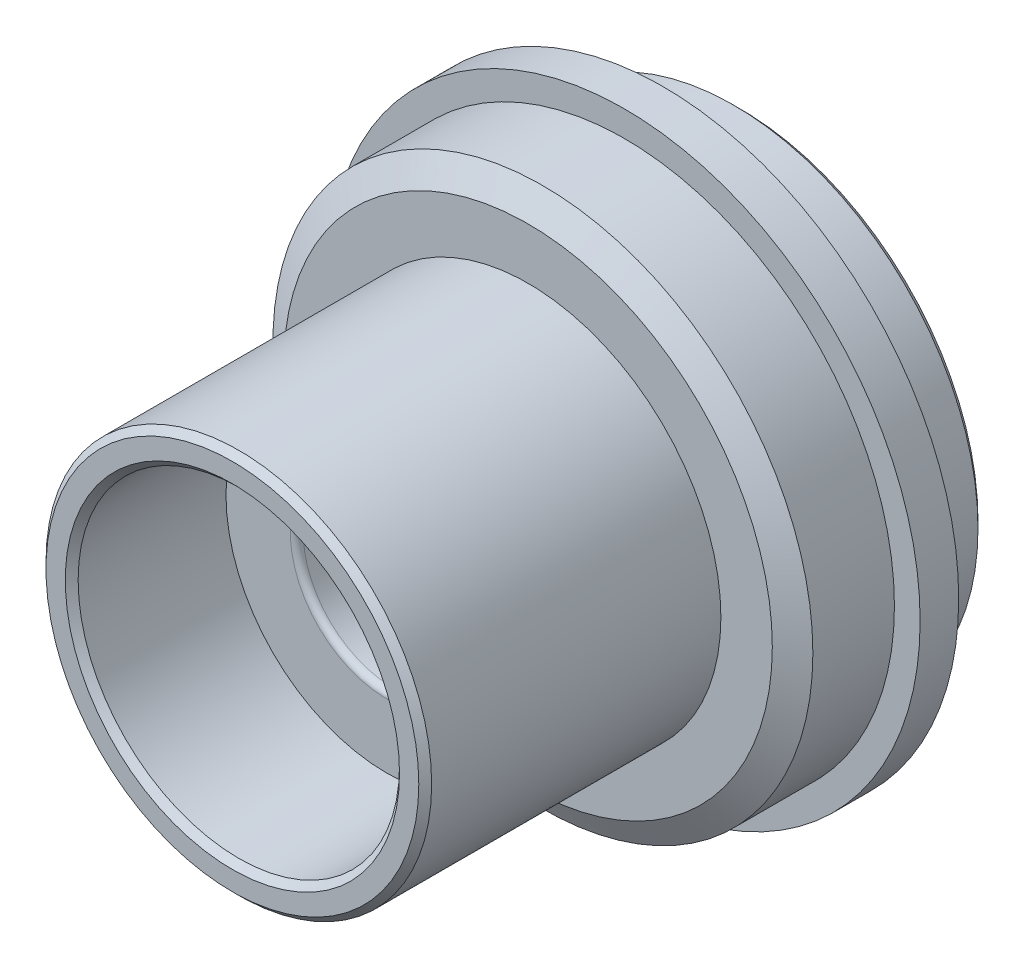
ISO-10303-21;
HEADER;
FILE_DESCRIPTION(('STEP AP214'),'2;1');
FILE_NAME('part.step','',(''),(''),'','','');
FILE_SCHEMA(('AUTOMOTIVE_DESIGN { 1 0 10303 214 1 1 1 1 }'));
ENDSEC;
DATA;
#1=APPLICATION_CONTEXT('core data for automotive mechanical design processes');
#2=APPLICATION_PROTOCOL_DEFINITION('international standard','automotive_design',2000,#1);
#3=PRODUCT_CONTEXT('',#1,'mechanical');
#4=PRODUCT('Part','Part','',(#3));
#5=PRODUCT_RELATED_PRODUCT_CATEGORY('part','',(#4));
#6=PRODUCT_DEFINITION_FORMATION('','',#4);
#7=PRODUCT_DEFINITION_CONTEXT('part definition',#1,'design');
#8=PRODUCT_DEFINITION('design','',#6,#7);
#9=PRODUCT_DEFINITION_SHAPE('','',#8);
#10=(LENGTH_UNIT() NAMED_UNIT(*) SI_UNIT(.MILLI.,.METRE.));
#11=(NAMED_UNIT(*) PLANE_ANGLE_UNIT() SI_UNIT($,.RADIAN.));
#12=(NAMED_UNIT(*) SI_UNIT($,.STERADIAN.) SOLID_ANGLE_UNIT());
#13=UNCERTAINTY_MEASURE_WITH_UNIT(LENGTH_MEASURE(1.E-05),#10,'distance_accuracy_value','');
#14=(GEOMETRIC_REPRESENTATION_CONTEXT(3) GLOBAL_UNCERTAINTY_ASSIGNED_CONTEXT((#13)) GLOBAL_UNIT_ASSIGNED_CONTEXT((#10,
#11,#12)) REPRESENTATION_CONTEXT('',''));
#15=CARTESIAN_POINT('',(0.,0.,0.));
#16=DIRECTION('',(0.,0.,1.));
#17=DIRECTION('',(1.,0.,0.));
#18=AXIS2_PLACEMENT_3D('',#15,#16,#17);
#19=CARTESIAN_POINT('',(0.,0.,0.));
#20=DIRECTION('',(0.,0.,1.));
#21=DIRECTION('',(1.,0.,0.));
#22=AXIS2_PLACEMENT_3D('',#19,#20,#21);
#23=CYLINDRICAL_SURFACE('',#22,7.);
#24=CARTESIAN_POINT('',(0.,0.,13.5));
#25=DIRECTION('',(0.,0.,-1.));
#26=DIRECTION('',(-1.,0.,0.));
#27=AXIS2_PLACEMENT_3D('',#24,#25,#26);
#28=CIRCLE('',#27,7.);
#29=CARTESIAN_POINT('',(-7.,0.,13.5));
#30=VERTEX_POINT('',#29);
#31=EDGE_CURVE('E265',#30,#30,#28,.T.);
#32=ORIENTED_EDGE('',*,*,#31,.T.);
#33=EDGE_LOOP('',(#32));
#34=FACE_BOUND('',#33,.T.);
#35=CARTESIAN_POINT('',(0.,0.,15.5));
#36=DIRECTION('',(0.,0.,-1.));
#37=DIRECTION('',(-1.,0.,0.));
#38=AXIS2_PLACEMENT_3D('',#35,#36,#37);
#39=CIRCLE('',#38,7.);
#40=CARTESIAN_POINT('',(-7.,0.,15.5));
#41=VERTEX_POINT('',#40);
#42=EDGE_CURVE('E259',#41,#41,#39,.F.);
#43=ORIENTED_EDGE('',*,*,#42,.T.);
#44=EDGE_LOOP('',(#43));
#45=FACE_BOUND('',#44,.T.);
#46=ADVANCED_FACE('F24',(#34,#45),#23,.F.);
#47=CARTESIAN_POINT('',(0.,0.,6.));
#48=DIRECTION('',(0.,0.,-1.));
#49=DIRECTION('',(-1.,0.,0.));
#50=AXIS2_PLACEMENT_3D('',#47,#48,#49);
#51=CYLINDRICAL_SURFACE('',#50,19.);
#52=CARTESIAN_POINT('',(0.,0.,0.500000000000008));
#53=DIRECTION('',(0.,0.,1.));
#54=DIRECTION('',(1.,0.,0.));
#55=AXIS2_PLACEMENT_3D('',#52,#53,#54);
#56=CIRCLE('',#55,19.);
#57=CARTESIAN_POINT('',(19.,0.,0.500000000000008));
#58=VERTEX_POINT('',#57);
#59=EDGE_CURVE('E289',#58,#58,#56,.T.);
#60=ORIENTED_EDGE('',*,*,#59,.T.);
#61=EDGE_LOOP('',(#60));
#62=FACE_BOUND('',#61,.T.);
#63=CARTESIAN_POINT('',(0.,0.,6.));
#64=DIRECTION('',(0.,0.,1.));
#65=DIRECTION('',(1.,0.,0.));
#66=AXIS2_PLACEMENT_3D('',#63,#64,#65);
#67=CIRCLE('',#66,19.);
#68=CARTESIAN_POINT('',(19.,0.,6.));
#69=VERTEX_POINT('',#68);
#70=EDGE_CURVE('E121',#69,#69,#67,.T.);
#71=ORIENTED_EDGE('',*,*,#70,.F.);
#72=EDGE_LOOP('',(#71));
#73=FACE_BOUND('',#72,.T.);
#74=ADVANCED_FACE('F26',(#62,#73),#51,.T.);
#75=CARTESIAN_POINT('',(0.,0.,0.));
#76=DIRECTION('',(0.,0.,1.));
#77=DIRECTION('',(1.,0.,0.));
#78=AXIS2_PLACEMENT_3D('',#75,#76,#77);
#79=PLANE('',#78);
#80=CARTESIAN_POINT('',(0.,0.,0.));
#81=DIRECTION('',(0.,0.,1.));
#82=DIRECTION('',(1.,0.,0.));
#83=AXIS2_PLACEMENT_3D('',#80,#81,#82);
#84=CIRCLE('',#83,18.5);
#85=CARTESIAN_POINT('',(18.5,0.,0.));
#86=VERTEX_POINT('',#85);
#87=EDGE_CURVE('E293',#86,#86,#84,.F.);
#88=ORIENTED_EDGE('',*,*,#87,.T.);
#89=EDGE_LOOP('',(#88));
#90=FACE_BOUND('',#89,.T.);
#91=DIRECTION('',(0.,1.,0.));
#92=VECTOR('',#91,1.);
#93=CARTESIAN_POINT('',(-2.5,14.3,0.));
#94=LINE('',#93,#92);
#95=CARTESIAN_POINT('',(-2.5,12.2474487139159,0.));
#96=VERTEX_POINT('',#95);
#97=CARTESIAN_POINT('',(-2.5,14.3,0.));
#98=VERTEX_POINT('',#97);
#99=EDGE_CURVE('E72',#96,#98,#94,.T.);
#100=ORIENTED_EDGE('',*,*,#99,.F.);
#101=CARTESIAN_POINT('',(0.,0.,0.));
#102=DIRECTION('',(0.,0.,1.));
#103=DIRECTION('',(1.,0.,0.));
#104=AXIS2_PLACEMENT_3D('',#101,#102,#103);
#105=CIRCLE('',#104,12.5);
#106=CARTESIAN_POINT('',(2.5,12.2474487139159,0.));
#107=VERTEX_POINT('',#106);
#108=EDGE_CURVE('E292',#96,#107,#105,.T.);
#109=ORIENTED_EDGE('',*,*,#108,.T.);
#110=DIRECTION('',(0.,-1.,0.));
#111=VECTOR('',#110,1.);
#112=CARTESIAN_POINT('',(2.5,14.3,0.));
#113=LINE('',#112,#111);
#114=CARTESIAN_POINT('',(2.5,14.3,0.));
#115=VERTEX_POINT('',#114);
#116=EDGE_CURVE('E93',#115,#107,#113,.T.);
#117=ORIENTED_EDGE('',*,*,#116,.F.);
#118=DIRECTION('',(1.,0.,0.));
#119=VECTOR('',#118,1.);
#120=CARTESIAN_POINT('',(2.5,14.3,0.));
#121=LINE('',#120,#119);
#122=EDGE_CURVE('E81',#98,#115,#121,.T.);
#123=ORIENTED_EDGE('',*,*,#122,.F.);
#124=EDGE_LOOP('',(#100,#109,#117,#123));
#125=FACE_BOUND('',#124,.T.);
#126=ADVANCED_FACE('F95',(#90,#125),#79,.F.);
#127=CARTESIAN_POINT('',(0.,0.,6.));
#128=DIRECTION('',(0.,0.,1.));
#129=DIRECTION('',(1.,0.,0.));
#130=AXIS2_PLACEMENT_3D('',#127,#128,#129);
#131=PLANE('',#130);
#132=CARTESIAN_POINT('',(0.,0.,6.));
#133=DIRECTION('',(0.,0.,1.));
#134=DIRECTION('',(1.,0.,0.));
#135=AXIS2_PLACEMENT_3D('',#132,#133,#134);
#136=CIRCLE('',#135,23.);
#137=CARTESIAN_POINT('',(23.,0.,6.));
#138=VERTEX_POINT('',#137);
#139=EDGE_CURVE('E112',#138,#138,#136,.T.);
#140=ORIENTED_EDGE('',*,*,#139,.F.);
#141=EDGE_LOOP('',(#140));
#142=FACE_BOUND('',#141,.T.);
#143=ORIENTED_EDGE('',*,*,#70,.T.);
#144=EDGE_LOOP('',(#143));
#145=FACE_BOUND('',#144,.T.);
#146=ADVANCED_FACE('F326',(#142,#145),#131,.F.);
#147=CARTESIAN_POINT('',(0.,0.,9.));
#148=DIRECTION('',(0.,0.,-1.));
#149=DIRECTION('',(-1.,0.,0.));
#150=AXIS2_PLACEMENT_3D('',#147,#148,#149);
#151=CYLINDRICAL_SURFACE('',#150,23.);
#152=CARTESIAN_POINT('',(0.,0.,9.));
#153=DIRECTION('',(0.,0.,1.));
#154=DIRECTION('',(1.,0.,0.));
#155=AXIS2_PLACEMENT_3D('',#152,#153,#154);
#156=CIRCLE('',#155,23.);
#157=CARTESIAN_POINT('',(23.,0.,9.));
#158=VERTEX_POINT('',#157);
#159=EDGE_CURVE('E124',#158,#158,#156,.T.);
#160=ORIENTED_EDGE('',*,*,#159,.F.);
#161=EDGE_LOOP('',(#160));
#162=FACE_BOUND('',#161,.T.);
#163=ORIENTED_EDGE('',*,*,#139,.T.);
#164=EDGE_LOOP('',(#163));
#165=FACE_BOUND('',#164,.T.);
#166=ADVANCED_FACE('F332',(#162,#165),#151,.T.);
#167=CARTESIAN_POINT('',(0.,0.,9.));
#168=DIRECTION('',(0.,0.,1.));
#169=DIRECTION('',(1.,0.,0.));
#170=AXIS2_PLACEMENT_3D('',#167,#168,#169);
#171=PLANE('',#170);
#172=CARTESIAN_POINT('',(0.,0.,9.));
#173=DIRECTION('',(0.,0.,1.));
#174=DIRECTION('',(1.,0.,0.));
#175=AXIS2_PLACEMENT_3D('',#172,#173,#174);
#176=CIRCLE('',#175,21.);
#177=CARTESIAN_POINT('',(21.,0.,9.));
#178=VERTEX_POINT('',#177);
#179=EDGE_CURVE('E118',#178,#178,#176,.T.);
#180=ORIENTED_EDGE('',*,*,#179,.F.);
#181=EDGE_LOOP('',(#180));
#182=FACE_BOUND('',#181,.T.);
#183=ORIENTED_EDGE('',*,*,#159,.T.);
#184=EDGE_LOOP('',(#183));
#185=FACE_BOUND('',#184,.T.);
#186=ADVANCED_FACE('F338',(#182,#185),#171,.T.);
#187=CARTESIAN_POINT('',(0.,0.,16.5));
#188=DIRECTION('',(0.,0.,-1.));
#189=DIRECTION('',(-1.,0.,0.));
#190=AXIS2_PLACEMENT_3D('',#187,#188,#189);
#191=CYLINDRICAL_SURFACE('',#190,21.);
#192=CARTESIAN_POINT('',(0.,0.,15.3452994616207));
#193=DIRECTION('',(0.,0.,1.));
#194=DIRECTION('',(1.,0.,0.));
#195=AXIS2_PLACEMENT_3D('',#192,#193,#194);
#196=CIRCLE('',#195,21.);
#197=CARTESIAN_POINT('',(21.,0.,15.3452994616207));
#198=VERTEX_POINT('',#197);
#199=EDGE_CURVE('E11',#198,#198,#196,.F.);
#200=ORIENTED_EDGE('',*,*,#199,.T.);
#201=EDGE_LOOP('',(#200));
#202=FACE_BOUND('',#201,.T.);
#203=ORIENTED_EDGE('',*,*,#179,.T.);
#204=EDGE_LOOP('',(#203));
#205=FACE_BOUND('',#204,.T.);
#206=ADVANCED_FACE('F344',(#202,#205),#191,.T.);
#207=CARTESIAN_POINT('',(0.,0.,16.5));
#208=DIRECTION('',(0.,0.,1.));
#209=DIRECTION('',(1.,0.,0.));
#210=AXIS2_PLACEMENT_3D('',#207,#208,#209);
#211=PLANE('',#210);
#212=CARTESIAN_POINT('',(0.,0.,16.5));
#213=DIRECTION('',(0.,0.,1.));
#214=DIRECTION('',(1.,0.,0.));
#215=AXIS2_PLACEMENT_3D('',#212,#213,#214);
#216=CIRCLE('',#215,19.);
#217=CARTESIAN_POINT('',(19.,0.,16.5));
#218=VERTEX_POINT('',#217);
#219=EDGE_CURVE('E32',#218,#218,#216,.T.);
#220=ORIENTED_EDGE('',*,*,#219,.T.);
#221=EDGE_LOOP('',(#220));
#222=FACE_BOUND('',#221,.T.);
#223=CARTESIAN_POINT('',(0.,0.,16.5));
#224=DIRECTION('',(0.,0.,1.));
#225=DIRECTION('',(1.,0.,0.));
#226=AXIS2_PLACEMENT_3D('',#223,#224,#225);
#227=CIRCLE('',#226,15.);
#228=CARTESIAN_POINT('',(15.,0.,16.5));
#229=VERTEX_POINT('',#228);
#230=EDGE_CURVE('E114',#229,#229,#227,.T.);
#231=ORIENTED_EDGE('',*,*,#230,.F.);
#232=EDGE_LOOP('',(#231));
#233=FACE_BOUND('',#232,.T.);
#234=ADVANCED_FACE('F304',(#222,#233),#211,.T.);
#235=CARTESIAN_POINT('',(0.,0.,39.5));
#236=DIRECTION('',(0.,0.,-1.));
#237=DIRECTION('',(-1.,0.,0.));
#238=AXIS2_PLACEMENT_3D('',#235,#236,#237);
#239=CYLINDRICAL_SURFACE('',#238,15.);
#240=CARTESIAN_POINT('',(0.,0.,39.));
#241=DIRECTION('',(0.,0.,1.));
#242=DIRECTION('',(1.,0.,0.));
#243=AXIS2_PLACEMENT_3D('',#240,#241,#242);
#244=CIRCLE('',#243,15.);
#245=CARTESIAN_POINT('',(15.,0.,39.));
#246=VERTEX_POINT('',#245);
#247=EDGE_CURVE('E283',#246,#246,#244,.F.);
#248=ORIENTED_EDGE('',*,*,#247,.T.);
#249=EDGE_LOOP('',(#248));
#250=FACE_BOUND('',#249,.T.);
#251=ORIENTED_EDGE('',*,*,#230,.T.);
#252=EDGE_LOOP('',(#251));
#253=FACE_BOUND('',#252,.T.);
#254=ADVANCED_FACE('F360',(#250,#253),#239,.T.);
#255=CARTESIAN_POINT('',(0.,0.,39.5));
#256=DIRECTION('',(0.,0.,1.));
#257=DIRECTION('',(1.,0.,0.));
#258=AXIS2_PLACEMENT_3D('',#255,#256,#257);
#259=PLANE('',#258);
#260=CARTESIAN_POINT('',(0.,0.,39.5));
#261=DIRECTION('',(0.,0.,1.));
#262=DIRECTION('',(1.,0.,0.));
#263=AXIS2_PLACEMENT_3D('',#260,#261,#262);
#264=CIRCLE('',#263,14.5);
#265=CARTESIAN_POINT('',(14.5,0.,39.5));
#266=VERTEX_POINT('',#265);
#267=EDGE_CURVE('E280',#266,#266,#264,.T.);
#268=ORIENTED_EDGE('',*,*,#267,.T.);
#269=EDGE_LOOP('',(#268));
#270=FACE_BOUND('',#269,.T.);
#271=CARTESIAN_POINT('',(0.,0.,39.5));
#272=DIRECTION('',(0.,0.,1.));
#273=DIRECTION('',(1.,0.,0.));
#274=AXIS2_PLACEMENT_3D('',#271,#272,#273);
#275=CIRCLE('',#274,13.);
#276=CARTESIAN_POINT('',(13.,0.,39.5));
#277=VERTEX_POINT('',#276);
#278=EDGE_CURVE('E277',#277,#277,#275,.F.);
#279=ORIENTED_EDGE('',*,*,#278,.T.);
#280=EDGE_LOOP('',(#279));
#281=FACE_BOUND('',#280,.T.);
#282=ADVANCED_FACE('F364',(#270,#281),#259,.T.);
#283=CARTESIAN_POINT('',(0.,0.,13.));
#284=DIRECTION('',(0.,0.,-1.));
#285=DIRECTION('',(-1.,0.,0.));
#286=AXIS2_PLACEMENT_3D('',#283,#284,#285);
#287=CYLINDRICAL_SURFACE('',#286,12.);
#288=DIRECTION('',(0.,0.,-1.));
#289=VECTOR('',#288,1.);
#290=CARTESIAN_POINT('',(2.5,11.7366945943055,13.));
#291=LINE('',#290,#289);
#292=CARTESIAN_POINT('',(2.5,11.7366945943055,6.00000000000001));
#293=VERTEX_POINT('',#292);
#294=CARTESIAN_POINT('',(2.5,11.7366945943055,0.500000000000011));
#295=VERTEX_POINT('',#294);
#296=EDGE_CURVE('E103',#293,#295,#291,.T.);
#297=ORIENTED_EDGE('',*,*,#296,.T.);
#298=CARTESIAN_POINT('',(0.,0.,0.500000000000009));
#299=DIRECTION('',(0.,0.,1.));
#300=DIRECTION('',(1.,0.,0.));
#301=AXIS2_PLACEMENT_3D('',#298,#299,#300);
#302=CIRCLE('',#301,12.);
#303=CARTESIAN_POINT('',(-2.5,11.7366945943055,0.500000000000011));
#304=VERTEX_POINT('',#303);
#305=EDGE_CURVE('E160',#295,#304,#302,.F.);
#306=ORIENTED_EDGE('',*,*,#305,.T.);
#307=DIRECTION('',(0.,0.,-1.));
#308=VECTOR('',#307,1.);
#309=CARTESIAN_POINT('',(-2.5,11.7366945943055,13.));
#310=LINE('',#309,#308);
#311=CARTESIAN_POINT('',(-2.5,11.7366945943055,6.00000000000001));
#312=VERTEX_POINT('',#311);
#313=EDGE_CURVE('E100',#304,#312,#310,.F.);
#314=ORIENTED_EDGE('',*,*,#313,.T.);
#315=CARTESIAN_POINT('',(0.,0.,6.00000000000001));
#316=DIRECTION('',(0.,0.,1.));
#317=DIRECTION('',(1.,0.,0.));
#318=AXIS2_PLACEMENT_3D('',#315,#316,#317);
#319=CIRCLE('',#318,12.);
#320=EDGE_CURVE('E108',#312,#293,#319,.T.);
#321=ORIENTED_EDGE('',*,*,#320,.T.);
#322=EDGE_LOOP('',(#297,#306,#314,#321));
#323=FACE_BOUND('',#322,.T.);
#324=ADVANCED_FACE('F298',(#323),#287,.F.);
#325=CARTESIAN_POINT('',(0.,11.,12.));
#326=DIRECTION('',(0.,0.,1.));
#327=DIRECTION('',(1.,0.,0.));
#328=AXIS2_PLACEMENT_3D('',#325,#326,#327);
#329=PLANE('',#328);
#330=CARTESIAN_POINT('',(0.,0.,12.));
#331=DIRECTION('',(0.,0.,-1.));
#332=DIRECTION('',(-1.,0.,0.));
#333=AXIS2_PLACEMENT_3D('',#330,#331,#332);
#334=CIRCLE('',#333,15.);
#335=CARTESIAN_POINT('',(-15.,0.,12.));
#336=VERTEX_POINT('',#335);
#337=EDGE_CURVE('E105',#336,#336,#334,.T.);
#338=ORIENTED_EDGE('',*,*,#337,.T.);
#339=EDGE_LOOP('',(#338));
#340=FACE_BOUND('',#339,.T.);
#341=CARTESIAN_POINT('',(0.,0.,12.));
#342=DIRECTION('',(0.,0.,1.));
#343=DIRECTION('',(1.,0.,0.));
#344=AXIS2_PLACEMENT_3D('',#341,#342,#343);
#345=CIRCLE('',#344,12.);
#346=CARTESIAN_POINT('',(-12.,0.,12.));
#347=VERTEX_POINT('',#346);
#348=EDGE_CURVE('E113',#347,#347,#345,.F.);
#349=ORIENTED_EDGE('',*,*,#348,.F.);
#350=EDGE_LOOP('',(#349));
#351=FACE_BOUND('',#350,.T.);
#352=ADVANCED_FACE('F373',(#340,#351),#329,.F.);
#353=CARTESIAN_POINT('',(0.,0.,4.));
#354=DIRECTION('',(0.,0.,1.));
#355=DIRECTION('',(1.,0.,0.));
#356=AXIS2_PLACEMENT_3D('',#353,#354,#355);
#357=CONICAL_SURFACE('',#356,11.,0.463647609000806);
#358=ORIENTED_EDGE('',*,*,#337,.F.);
#359=EDGE_LOOP('',(#358));
#360=FACE_BOUND('',#359,.T.);
#361=CARTESIAN_POINT('',(-5.64154935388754,14.3,12.7452161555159));
#362=CARTESIAN_POINT('',(-5.5039150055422,14.3,12.6442071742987));
#363=CARTESIAN_POINT('',(-5.36475080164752,14.3,12.5452525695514));
#364=CARTESIAN_POINT('',(-5.08327714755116,14.3,12.352080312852));
#365=CARTESIAN_POINT('',(-4.94096927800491,14.3,12.2578603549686));
#366=CARTESIAN_POINT('',(-4.65222855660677,14.3,12.0742022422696));
#367=CARTESIAN_POINT('',(-4.50577791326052,14.3,11.9847919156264));
#368=CARTESIAN_POINT('',(-4.20925875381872,14.3,11.8119258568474));
#369=CARTESIAN_POINT('',(-4.05918745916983,14.3,11.728474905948));
#370=CARTESIAN_POINT('',(-3.59931811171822,14.3,11.4860501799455));
#371=CARTESIAN_POINT('',(-3.28384265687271,14.3,11.3375825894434));
#372=CARTESIAN_POINT('',(-2.63868083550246,14.3,11.0759871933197));
#373=CARTESIAN_POINT('',(-2.3090112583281,14.3,10.9628188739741));
#374=CARTESIAN_POINT('',(-1.76051384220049,14.3,10.8128303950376));
#375=CARTESIAN_POINT('',(-1.5451576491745,14.3,10.7632204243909));
#376=CARTESIAN_POINT('',(-1.1108756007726,14.3,10.6829113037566));
#377=CARTESIAN_POINT('',(-0.891949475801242,14.3,10.6522135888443));
#378=CARTESIAN_POINT('',(-0.454185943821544,14.3,10.6111106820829));
#379=CARTESIAN_POINT('',(-0.235365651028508,14.3,10.6005244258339));
#380=CARTESIAN_POINT('',(0.202314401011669,14.3,10.5995137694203));
#381=CARTESIAN_POINT('',(0.421174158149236,14.3,10.609088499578));
#382=CARTESIAN_POINT('',(0.856577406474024,14.3,10.6479686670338));
#383=CARTESIAN_POINT('',(1.07312524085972,14.3,10.6772259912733));
#384=CARTESIAN_POINT('',(1.50286958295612,14.3,10.7543245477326));
#385=CARTESIAN_POINT('',(1.71606583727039,14.3,10.8021671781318));
#386=CARTESIAN_POINT('',(2.13997521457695,14.3,10.9153881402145));
#387=CARTESIAN_POINT('',(2.35064290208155,14.3,10.9809352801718));
#388=CARTESIAN_POINT('',(2.76649040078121,14.3,11.1274136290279));
#389=CARTESIAN_POINT('',(2.97167044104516,14.3,11.208344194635));
#390=CARTESIAN_POINT('',(3.50353722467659,14.3,11.4388330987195));
#391=CARTESIAN_POINT('',(3.82541391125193,14.3,11.599524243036));
#392=CARTESIAN_POINT('',(4.45388953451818,14.3,11.9490060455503));
#393=CARTESIAN_POINT('',(4.76046292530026,14.3,12.1378417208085));
#394=CARTESIAN_POINT('',(5.35180577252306,14.3,12.5323463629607));
#395=CARTESIAN_POINT('',(5.63692327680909,14.3,12.7374976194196));
#396=CARTESIAN_POINT('',(6.05470028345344,14.3,13.0569122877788));
#397=CARTESIAN_POINT('',(6.19206139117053,14.3,13.1651183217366));
#398=CARTESIAN_POINT('',(6.46385141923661,14.3,13.3850896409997));
#399=CARTESIAN_POINT('',(6.59828103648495,14.3,13.4968540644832));
#400=CARTESIAN_POINT('',(6.73136346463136,14.3,13.6102043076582));
#401=B_SPLINE_CURVE_WITH_KNOTS('',3,(#361,#362,#363,#364,#365,#366,#367,#368,#369,#370,#371,
#372,#373,#374,#375,#376,#377,#378,#379,#380,#381,#382,#383,#384,#385,#386,#387,#388,#389,#390,
#391,#392,#393,#394,#395,#396,#397,#398,#399,#400),.UNSPECIFIED.,.F.,.F.,(4,2,2,2,2,2,2,2,2,2,2,
2,2,2,2,2,2,2,2,4),(0.,0.512172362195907,1.02409281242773,1.53871208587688,2.05373970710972,
3.0979690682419,4.14099549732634,4.80324778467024,5.46555031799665,6.12186131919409,
6.7781440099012,7.43282825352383,8.08756175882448,8.74877293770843,9.4099564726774,
10.4873153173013,11.5664162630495,12.619413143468,13.1439507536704,13.6683622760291),.UNSPECIFIED.);
#402=CARTESIAN_POINT('',(-2.5,14.3,11.0337734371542));
#403=VERTEX_POINT('',#402);
#404=CARTESIAN_POINT('',(2.5,14.3,11.0337734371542));
#405=VERTEX_POINT('',#404);
#406=EDGE_CURVE('E90',#403,#405,#401,.T.);
#407=ORIENTED_EDGE('',*,*,#406,.T.);
#408=CARTESIAN_POINT('',(2.5,18.3533716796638,19.0457151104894));
#409=CARTESIAN_POINT('',(2.5,17.8120951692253,17.97311422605));
#410=CARTESIAN_POINT('',(2.5,17.2705062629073,16.900670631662));
#411=CARTESIAN_POINT('',(2.5,16.1864065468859,14.7562584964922));
#412=CARTESIAN_POINT('',(2.5,15.6438957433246,13.6842899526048));
#413=CARTESIAN_POINT('',(2.5,14.5576747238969,11.5410269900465));
#414=CARTESIAN_POINT('',(2.5,14.0139645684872,10.4697325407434));
#415=CARTESIAN_POINT('',(2.5,12.924820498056,8.32800977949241));
#416=CARTESIAN_POINT('',(2.5,12.3793865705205,7.25758147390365));
#417=CARTESIAN_POINT('',(2.5,11.5593129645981,5.65286980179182));
#418=CARTESIAN_POINT('',(2.5,11.2856241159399,5.1181005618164));
#419=CARTESIAN_POINT('',(2.5,10.7374552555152,4.04896819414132));
#420=CARTESIAN_POINT('',(2.5,10.4629752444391,3.5146050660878));
#421=CARTESIAN_POINT('',(2.5,9.91302711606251,2.44639931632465));
#422=CARTESIAN_POINT('',(2.5,9.63755901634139,1.91255668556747));
#423=CARTESIAN_POINT('',(2.5,9.08534895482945,0.845528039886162));
#424=CARTESIAN_POINT('',(2.5,8.80860698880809,0.312342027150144));
#425=CARTESIAN_POINT('',(2.5,8.25343259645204,-0.753197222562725));
#426=CARTESIAN_POINT('',(2.5,7.97500005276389,-1.28555039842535));
#427=CARTESIAN_POINT('',(2.5,7.41588785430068,-2.34907115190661));
#428=CARTESIAN_POINT('',(2.5,7.13520822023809,-2.88023874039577));
#429=CARTESIAN_POINT('',(2.5,6.71180956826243,-3.67574522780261));
#430=CARTESIAN_POINT('',(2.5,6.57027569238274,-3.94071483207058));
#431=CARTESIAN_POINT('',(2.5,6.28624966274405,-4.47013917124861));
#432=CARTESIAN_POINT('',(2.5,6.14375751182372,-4.73459390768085));
#433=CARTESIAN_POINT('',(2.5,5.85760866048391,-5.26288390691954));
#434=CARTESIAN_POINT('',(2.5,5.71395192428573,-5.52671915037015));
#435=CARTESIAN_POINT('',(2.5,5.42518080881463,-6.05359387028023));
#436=CARTESIAN_POINT('',(2.5,5.28006641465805,-6.31663333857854));
#437=CARTESIAN_POINT('',(2.5,5.1340759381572,-6.57918816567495));
#438=B_SPLINE_CURVE_WITH_KNOTS('',3,(#408,#409,#410,#411,#412,#413,#414,#415,#416,#417,#418,
#419,#420,#421,#422,#423,#424,#425,#426,#427,#428,#429,#430,#431,#432,#433,#434,#435,#436,#437),
.UNSPECIFIED.,.F.,.F.,(4,2,2,2,2,2,2,2,2,2,2,2,2,2,4),(0.,3.6043140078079,7.20860409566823,
10.812716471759,14.4168550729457,16.2190625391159,18.0212684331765,19.8234424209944,
21.6256223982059,23.4279289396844,25.2302188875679,26.1314201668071,27.032618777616,
27.9338451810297,28.8350807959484),.UNSPECIFIED.);
#439=EDGE_CURVE('E235',#405,#293,#438,.T.);
#440=ORIENTED_EDGE('',*,*,#439,.T.);
#441=ORIENTED_EDGE('',*,*,#320,.F.);
#442=CARTESIAN_POINT('',(-2.5,5.1340759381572,-6.57918816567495));
#443=CARTESIAN_POINT('',(-2.5,5.29390558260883,-6.29173197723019));
#444=CARTESIAN_POINT('',(-2.5,5.4526920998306,-6.00369919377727));
#445=CARTESIAN_POINT('',(-2.5,5.76855210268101,-5.42669995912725));
#446=CARTESIAN_POINT('',(-2.5,5.92562560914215,-5.1377335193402));
#447=CARTESIAN_POINT('',(-2.5,6.2384313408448,-4.55908937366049));
#448=CARTESIAN_POINT('',(-2.5,6.39416361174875,-4.26941169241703));
#449=CARTESIAN_POINT('',(-2.5,6.70454004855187,-3.68947295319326));
#450=CARTESIAN_POINT('',(-2.5,6.85918421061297,-3.39921189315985));
#451=CARTESIAN_POINT('',(-2.5,7.32176885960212,-2.52776389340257));
#452=CARTESIAN_POINT('',(-2.5,7.62838266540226,-1.94587285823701));
#453=CARTESIAN_POINT('',(-2.5,8.23915117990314,-0.780796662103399));
#454=CARTESIAN_POINT('',(-2.5,8.543305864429,-0.197611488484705));
#455=CARTESIAN_POINT('',(-2.5,9.09726405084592,0.868553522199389));
#456=CARTESIAN_POINT('',(-2.5,9.34735254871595,1.35138536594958));
#457=CARTESIAN_POINT('',(-2.5,9.84655550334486,2.31754990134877));
#458=CARTESIAN_POINT('',(-2.5,10.0956699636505,2.80088259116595));
#459=CARTESIAN_POINT('',(-2.5,10.8418680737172,4.25150407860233));
#460=CARTESIAN_POINT('',(-2.5,11.3377923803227,5.21938915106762));
#461=CARTESIAN_POINT('',(-2.5,12.3794128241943,7.25764547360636));
#462=CARTESIAN_POINT('',(-2.5,12.9248814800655,8.32813286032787));
#463=CARTESIAN_POINT('',(-2.5,14.0140944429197,10.4699847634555));
#464=CARTESIAN_POINT('',(-2.5,14.557838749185,11.5413492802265));
#465=CARTESIAN_POINT('',(-2.5,15.6440630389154,13.6846214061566));
#466=CARTESIAN_POINT('',(-2.5,16.1865431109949,14.7565289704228));
#467=CARTESIAN_POINT('',(-2.5,17.2705769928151,16.900810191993));
#468=CARTESIAN_POINT('',(-2.5,17.8121308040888,17.973183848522));
#469=CARTESIAN_POINT('',(-2.5,18.3533716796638,19.0457151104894));
#470=B_SPLINE_CURVE_WITH_KNOTS('',3,(#442,#443,#444,#445,#446,#447,#448,#449,#450,#451,#452,
#453,#454,#455,#456,#457,#458,#459,#460,#461,#462,#463,#464,#465,#466,#467,#468,#469),
.UNSPECIFIED.,.F.,.F.,(4,2,2,2,2,2,2,2,2,2,2,2,2,4),(0.,0.986699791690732,1.97338757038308,
2.96004162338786,3.94669915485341,5.91988038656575,7.89308099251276,9.52434835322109,
11.1556097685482,14.4182243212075,18.0225688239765,21.6269148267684,25.2310000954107,
28.835079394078),.UNSPECIFIED.);
#471=EDGE_CURVE('E117',#312,#403,#470,.T.);
#472=ORIENTED_EDGE('',*,*,#471,.T.);
#473=EDGE_LOOP('',(#407,#440,#441,#472));
#474=FACE_BOUND('',#473,.T.);
#475=ADVANCED_FACE('F144',(#360,#474),#357,.F.);
#476=CARTESIAN_POINT('',(0.,0.,13.));
#477=DIRECTION('',(0.,0.,-1.));
#478=DIRECTION('',(-1.,0.,0.));
#479=AXIS2_PLACEMENT_3D('',#476,#477,#478);
#480=PLANE('',#479);
#481=CARTESIAN_POINT('',(0.,0.,13.));
#482=DIRECTION('',(0.,0.,-1.));
#483=DIRECTION('',(-1.,0.,0.));
#484=AXIS2_PLACEMENT_3D('',#481,#482,#483);
#485=CIRCLE('',#484,7.5);
#486=CARTESIAN_POINT('',(-7.5,0.,13.));
#487=VERTEX_POINT('',#486);
#488=EDGE_CURVE('E268',#487,#487,#485,.F.);
#489=ORIENTED_EDGE('',*,*,#488,.T.);
#490=EDGE_LOOP('',(#489));
#491=FACE_BOUND('',#490,.T.);
#492=CARTESIAN_POINT('',(0.,0.,13.));
#493=DIRECTION('',(0.,0.,-1.));
#494=DIRECTION('',(-1.,0.,0.));
#495=AXIS2_PLACEMENT_3D('',#492,#493,#494);
#496=CIRCLE('',#495,12.);
#497=CARTESIAN_POINT('',(-12.,0.,13.));
#498=VERTEX_POINT('',#497);
#499=EDGE_CURVE('E109',#498,#498,#496,.T.);
#500=ORIENTED_EDGE('',*,*,#499,.T.);
#501=EDGE_LOOP('',(#500));
#502=FACE_BOUND('',#501,.T.);
#503=ADVANCED_FACE('F374',(#491,#502),#480,.T.);
#504=CARTESIAN_POINT('',(-12.,0.,12.));
#505=CARTESIAN_POINT('',(-12.,0.,12.0104166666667));
#506=CARTESIAN_POINT('',(-12.,0.,12.0208333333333));
#507=CARTESIAN_POINT('',(-12.,0.,12.0416666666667));
#508=CARTESIAN_POINT('',(-12.,0.,12.0520833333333));
#509=CARTESIAN_POINT('',(-12.,0.,12.0729166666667));
#510=CARTESIAN_POINT('',(-12.,0.,12.0833333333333));
#511=CARTESIAN_POINT('',(-12.,0.,12.1041666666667));
#512=CARTESIAN_POINT('',(-12.,0.,12.1145833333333));
#513=CARTESIAN_POINT('',(-12.,0.,12.1354166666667));
#514=CARTESIAN_POINT('',(-12.,0.,12.1458333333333));
#515=CARTESIAN_POINT('',(-12.,0.,12.1666666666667));
#516=CARTESIAN_POINT('',(-12.,0.,12.1770833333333));
#517=CARTESIAN_POINT('',(-12.,0.,12.1979166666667));
#518=CARTESIAN_POINT('',(-12.,0.,12.2083333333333));
#519=CARTESIAN_POINT('',(-12.,0.,12.2291666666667));
#520=CARTESIAN_POINT('',(-12.,0.,12.2395833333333));
#521=CARTESIAN_POINT('',(-12.,0.,12.2604166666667));
#522=CARTESIAN_POINT('',(-12.,0.,12.2708333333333));
#523=CARTESIAN_POINT('',(-12.,0.,12.2916666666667));
#524=CARTESIAN_POINT('',(-12.,0.,12.3020833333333));
#525=CARTESIAN_POINT('',(-12.,0.,12.3229166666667));
#526=CARTESIAN_POINT('',(-12.,0.,12.3333333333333));
#527=CARTESIAN_POINT('',(-12.,0.,12.3541666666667));
#528=CARTESIAN_POINT('',(-12.,0.,12.3645833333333));
#529=CARTESIAN_POINT('',(-12.,0.,12.3854166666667));
#530=CARTESIAN_POINT('',(-12.,0.,12.3958333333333));
#531=CARTESIAN_POINT('',(-12.,0.,12.4166666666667));
#532=CARTESIAN_POINT('',(-12.,0.,12.4270833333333));
#533=CARTESIAN_POINT('',(-12.,0.,12.4479166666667));
#534=CARTESIAN_POINT('',(-12.,0.,12.4583333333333));
#535=CARTESIAN_POINT('',(-12.,0.,12.4791666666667));
#536=CARTESIAN_POINT('',(-12.,0.,12.4895833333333));
#537=CARTESIAN_POINT('',(-12.,0.,12.5104166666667));
#538=CARTESIAN_POINT('',(-12.,0.,12.5208333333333));
#539=CARTESIAN_POINT('',(-12.,0.,12.5416666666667));
#540=CARTESIAN_POINT('',(-12.,0.,12.5520833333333));
#541=CARTESIAN_POINT('',(-12.,0.,12.5729166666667));
#542=CARTESIAN_POINT('',(-12.,0.,12.5833333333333));
#543=CARTESIAN_POINT('',(-12.,0.,12.6041666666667));
#544=CARTESIAN_POINT('',(-12.,0.,12.6145833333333));
#545=CARTESIAN_POINT('',(-12.,0.,12.6354166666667));
#546=CARTESIAN_POINT('',(-12.,0.,12.6458333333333));
#547=CARTESIAN_POINT('',(-12.,0.,12.6666666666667));
#548=CARTESIAN_POINT('',(-12.,0.,12.6770833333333));
#549=CARTESIAN_POINT('',(-12.,0.,12.6979166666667));
#550=CARTESIAN_POINT('',(-12.,0.,12.7083333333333));
#551=CARTESIAN_POINT('',(-12.,0.,12.7291666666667));
#552=CARTESIAN_POINT('',(-12.,0.,12.7395833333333));
#553=CARTESIAN_POINT('',(-12.,0.,12.7604166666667));
#554=CARTESIAN_POINT('',(-12.,0.,12.7708333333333));
#555=CARTESIAN_POINT('',(-12.,0.,12.7916666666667));
#556=CARTESIAN_POINT('',(-12.,0.,12.8020833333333));
#557=CARTESIAN_POINT('',(-12.,0.,12.8229166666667));
#558=CARTESIAN_POINT('',(-12.,0.,12.8333333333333));
#559=CARTESIAN_POINT('',(-12.,0.,12.8541666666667));
#560=CARTESIAN_POINT('',(-12.,0.,12.8645833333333));
#561=CARTESIAN_POINT('',(-12.,0.,12.8854166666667));
#562=CARTESIAN_POINT('',(-12.,0.,12.8958333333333));
#563=CARTESIAN_POINT('',(-12.,0.,12.9166666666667));
#564=CARTESIAN_POINT('',(-12.,0.,12.9270833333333));
#565=CARTESIAN_POINT('',(-12.,0.,12.9479166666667));
#566=CARTESIAN_POINT('',(-12.,0.,12.9583333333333));
#567=CARTESIAN_POINT('',(-12.,0.,12.9791666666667));
#568=CARTESIAN_POINT('',(-12.,0.,12.9895833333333));
#569=CARTESIAN_POINT('',(-12.,0.,13.));
#570=B_SPLINE_CURVE_WITH_KNOTS('',3,(#504,#505,#506,#507,#508,#509,#510,#511,#512,#513,#514,
#515,#516,#517,#518,#519,#520,#521,#522,#523,#524,#525,#526,#527,#528,#529,#530,#531,#532,#533,
#534,#535,#536,#537,#538,#539,#540,#541,#542,#543,#544,#545,#546,#547,#548,#549,#550,#551,#552,
#553,#554,#555,#556,#557,#558,#559,#560,#561,#562,#563,#564,#565,#566,#567,#568,#569),
.UNSPECIFIED.,.F.,.F.,(4,2,2,2,2,2,2,2,2,2,2,2,2,2,2,2,2,2,2,2,2,2,2,2,2,2,2,2,2,2,2,2,4),(0.,
0.03125,0.0625000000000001,0.0937500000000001,0.125,0.15625,0.1875,0.21875,0.25,0.28125,0.3125,
0.34375,0.375,0.40625,0.4375,0.46875,0.5,0.53125,0.5625,0.593750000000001,0.625000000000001,
0.656250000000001,0.687500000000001,0.718750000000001,0.750000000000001,0.781250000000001,
0.812500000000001,0.843750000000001,0.875000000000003,0.906250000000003,0.937500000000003,
0.968750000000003,1.),.UNSPECIFIED.);
#571=EDGE_CURVE('BSEAM233',#347,#498,#570,.T.);
#572=ORIENTED_EDGE('',*,*,#348,.T.);
#573=ORIENTED_EDGE('',*,*,#499,.F.);
#574=ORIENTED_EDGE('',*,*,#571,.T.);
#575=ORIENTED_EDGE('',*,*,#571,.F.);
#576=EDGE_LOOP('',(#572,#574,#573,#575));
#577=FACE_BOUND('',#576,.T.);
#578=ADVANCED_FACE('F233',(#577),#287,.F.);
#579=CARTESIAN_POINT('',(2.5,14.3,12.));
#580=DIRECTION('',(1.,0.,0.));
#581=DIRECTION('',(0.,1.,0.));
#582=AXIS2_PLACEMENT_3D('',#579,#580,#581);
#583=PLANE('',#582);
#584=ORIENTED_EDGE('',*,*,#116,.T.);
#585=CARTESIAN_POINT('',(2.5,12.2474487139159,0.));
#586=CARTESIAN_POINT('',(2.5,12.1623599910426,0.083371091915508));
#587=CARTESIAN_POINT('',(2.5,12.0772527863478,0.166723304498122));
#588=CARTESIAN_POINT('',(2.5,11.9070014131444,0.333389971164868));
#589=CARTESIAN_POINT('',(2.5,11.8218572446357,0.416704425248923));
#590=CARTESIAN_POINT('',(2.5,11.7366945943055,0.500000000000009));
#591=B_SPLINE_CURVE_WITH_KNOTS('',3,(#585,#586,#587,#588,#589,#590),.UNSPECIFIED.,.F.,.F.,(4,2,
4),(0.,0.357375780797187,0.714751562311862),.UNSPECIFIED.);
#592=EDGE_CURVE('E47',#107,#295,#591,.T.);
#593=ORIENTED_EDGE('',*,*,#592,.T.);
#594=ORIENTED_EDGE('',*,*,#296,.F.);
#595=ORIENTED_EDGE('',*,*,#439,.F.);
#596=DIRECTION('',(0.,0.,-1.));
#597=VECTOR('',#596,1.);
#598=CARTESIAN_POINT('',(2.5,14.3,12.));
#599=LINE('',#598,#597);
#600=EDGE_CURVE('E92',#405,#115,#599,.T.);
#601=ORIENTED_EDGE('',*,*,#600,.T.);
#602=EDGE_LOOP('',(#584,#593,#594,#595,#601));
#603=FACE_BOUND('',#602,.T.);
#604=ADVANCED_FACE('F230',(#603),#583,.F.);
#605=CARTESIAN_POINT('',(2.5,14.3,12.));
#606=DIRECTION('',(0.,1.,0.));
#607=DIRECTION('',(0.,0.,1.));
#608=AXIS2_PLACEMENT_3D('',#605,#606,#607);
#609=PLANE('',#608);
#610=DIRECTION('',(0.,0.,-1.));
#611=VECTOR('',#610,1.);
#612=CARTESIAN_POINT('',(-2.5,14.3,12.));
#613=LINE('',#612,#611);
#614=EDGE_CURVE('E77',#403,#98,#613,.T.);
#615=ORIENTED_EDGE('',*,*,#614,.T.);
#616=ORIENTED_EDGE('',*,*,#122,.T.);
#617=ORIENTED_EDGE('',*,*,#600,.F.);
#618=ORIENTED_EDGE('',*,*,#406,.F.);
#619=EDGE_LOOP('',(#615,#616,#617,#618));
#620=FACE_BOUND('',#619,.T.);
#621=ADVANCED_FACE('F86',(#620),#609,.F.);
#622=CARTESIAN_POINT('',(-2.5,14.3,12.));
#623=DIRECTION('',(-1.,0.,0.));
#624=DIRECTION('',(0.,-1.,0.));
#625=AXIS2_PLACEMENT_3D('',#622,#623,#624);
#626=PLANE('',#625);
#627=ORIENTED_EDGE('',*,*,#313,.F.);
#628=CARTESIAN_POINT('',(-2.5,11.7366945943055,0.500000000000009));
#629=CARTESIAN_POINT('',(-2.5,11.8218572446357,0.416704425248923));
#630=CARTESIAN_POINT('',(-2.5,11.9070014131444,0.333389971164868));
#631=CARTESIAN_POINT('',(-2.5,12.0772527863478,0.166723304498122));
#632=CARTESIAN_POINT('',(-2.5,12.1623599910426,0.0833710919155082));
#633=CARTESIAN_POINT('',(-2.5,12.2474487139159,0.));
#634=B_SPLINE_CURVE_WITH_KNOTS('',3,(#628,#629,#630,#631,#632,#633),.UNSPECIFIED.,.F.,.F.,(4,2,
4),(0.,0.357375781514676,0.714751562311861),.UNSPECIFIED.);
#635=EDGE_CURVE('E39',#304,#96,#634,.T.);
#636=ORIENTED_EDGE('',*,*,#635,.T.);
#637=ORIENTED_EDGE('',*,*,#99,.T.);
#638=ORIENTED_EDGE('',*,*,#614,.F.);
#639=ORIENTED_EDGE('',*,*,#471,.F.);
#640=EDGE_LOOP('',(#627,#636,#637,#638,#639));
#641=FACE_BOUND('',#640,.T.);
#642=ADVANCED_FACE('F75',(#641),#626,.F.);
#643=CARTESIAN_POINT('',(0.,0.,27.5));
#644=DIRECTION('',(0.,0.,1.));
#645=DIRECTION('',(1.,0.,0.));
#646=AXIS2_PLACEMENT_3D('',#643,#644,#645);
#647=CYLINDRICAL_SURFACE('',#646,12.5);
#648=CARTESIAN_POINT('',(0.,0.,39.));
#649=DIRECTION('',(0.,0.,1.));
#650=DIRECTION('',(1.,0.,0.));
#651=AXIS2_PLACEMENT_3D('',#648,#649,#650);
#652=CIRCLE('',#651,12.5);
#653=CARTESIAN_POINT('',(12.5,0.,39.));
#654=VERTEX_POINT('',#653);
#655=EDGE_CURVE('E286',#654,#654,#652,.T.);
#656=ORIENTED_EDGE('',*,*,#655,.T.);
#657=EDGE_LOOP('',(#656));
#658=FACE_BOUND('',#657,.T.);
#659=CARTESIAN_POINT('',(0.,0.,27.5));
#660=DIRECTION('',(0.,0.,1.));
#661=DIRECTION('',(1.,0.,0.));
#662=AXIS2_PLACEMENT_3D('',#659,#660,#661);
#663=CIRCLE('',#662,12.5);
#664=CARTESIAN_POINT('',(12.5,0.,27.5));
#665=VERTEX_POINT('',#664);
#666=EDGE_CURVE('E82',#665,#665,#663,.T.);
#667=ORIENTED_EDGE('',*,*,#666,.F.);
#668=EDGE_LOOP('',(#667));
#669=FACE_BOUND('',#668,.T.);
#670=ADVANCED_FACE('F149',(#658,#669),#647,.F.);
#671=CARTESIAN_POINT('',(0.,0.,27.5));
#672=DIRECTION('',(0.,0.,1.));
#673=DIRECTION('',(1.,0.,0.));
#674=AXIS2_PLACEMENT_3D('',#671,#672,#673);
#675=PLANE('',#674);
#676=CARTESIAN_POINT('',(0.,0.,27.5));
#677=DIRECTION('',(0.,0.,1.));
#678=DIRECTION('',(1.,0.,0.));
#679=AXIS2_PLACEMENT_3D('',#676,#677,#678);
#680=CIRCLE('',#679,7.5);
#681=CARTESIAN_POINT('',(7.5,0.,27.5));
#682=VERTEX_POINT('',#681);
#683=EDGE_CURVE('E274',#682,#682,#680,.F.);
#684=ORIENTED_EDGE('',*,*,#683,.T.);
#685=EDGE_LOOP('',(#684));
#686=FACE_BOUND('',#685,.T.);
#687=ORIENTED_EDGE('',*,*,#666,.T.);
#688=EDGE_LOOP('',(#687));
#689=FACE_BOUND('',#688,.T.);
#690=ADVANCED_FACE('F223',(#686,#689),#675,.T.);
#691=CARTESIAN_POINT('',(0.,0.,27.));
#692=DIRECTION('',(0.,0.,1.));
#693=DIRECTION('',(1.,0.,0.));
#694=AXIS2_PLACEMENT_3D('',#691,#692,#693);
#695=CIRCLE('',#694,7.);
#696=CARTESIAN_POINT('',(7.,0.,27.));
#697=VERTEX_POINT('',#696);
#698=EDGE_CURVE('E271',#697,#697,#695,.T.);
#699=ORIENTED_EDGE('',*,*,#698,.T.);
#700=EDGE_LOOP('',(#699));
#701=FACE_BOUND('',#700,.T.);
#702=CARTESIAN_POINT('',(0.,0.,19.1));
#703=DIRECTION('',(0.,0.,1.));
#704=DIRECTION('',(1.,0.,0.));
#705=AXIS2_PLACEMENT_3D('',#702,#703,#704);
#706=CIRCLE('',#705,7.);
#707=CARTESIAN_POINT('',(7.,0.,19.1));
#708=VERTEX_POINT('',#707);
#709=EDGE_CURVE('E253',#708,#708,#706,.F.);
#710=ORIENTED_EDGE('',*,*,#709,.T.);
#711=EDGE_LOOP('',(#710));
#712=FACE_BOUND('',#711,.T.);
#713=ADVANCED_FACE('F219',(#701,#712),#23,.F.);
#714=CARTESIAN_POINT('',(0.,9.3,15.6));
#715=DIRECTION('',(0.,0.,-1.));
#716=DIRECTION('',(-1.,0.,0.));
#717=AXIS2_PLACEMENT_3D('',#714,#715,#716);
#718=PLANE('',#717);
#719=CARTESIAN_POINT('',(0.,0.,15.6));
#720=DIRECTION('',(0.,0.,-1.));
#721=DIRECTION('',(-1.,0.,0.));
#722=AXIS2_PLACEMENT_3D('',#719,#720,#721);
#723=CIRCLE('',#722,7.1);
#724=CARTESIAN_POINT('',(-7.1,0.,15.6));
#725=VERTEX_POINT('',#724);
#726=EDGE_CURVE('E262',#725,#725,#723,.T.);
#727=ORIENTED_EDGE('',*,*,#726,.T.);
#728=EDGE_LOOP('',(#727));
#729=FACE_BOUND('',#728,.T.);
#730=CARTESIAN_POINT('',(0.,0.,15.6));
#731=DIRECTION('',(0.,0.,-1.));
#732=DIRECTION('',(-1.,0.,0.));
#733=AXIS2_PLACEMENT_3D('',#730,#731,#732);
#734=CIRCLE('',#733,8.76);
#735=CARTESIAN_POINT('',(-8.76,0.,15.6));
#736=VERTEX_POINT('',#735);
#737=EDGE_CURVE('E250',#736,#736,#734,.F.);
#738=ORIENTED_EDGE('',*,*,#737,.T.);
#739=EDGE_LOOP('',(#738));
#740=FACE_BOUND('',#739,.T.);
#741=ADVANCED_FACE('F215',(#729,#740),#718,.F.);
#742=CARTESIAN_POINT('',(0.,9.3,19.));
#743=DIRECTION('',(0.,0.,1.));
#744=DIRECTION('',(1.,0.,0.));
#745=AXIS2_PLACEMENT_3D('',#742,#743,#744);
#746=PLANE('',#745);
#747=CARTESIAN_POINT('',(0.,0.,19.));
#748=DIRECTION('',(0.,0.,1.));
#749=DIRECTION('',(1.,0.,0.));
#750=AXIS2_PLACEMENT_3D('',#747,#748,#749);
#751=CIRCLE('',#750,7.1);
#752=CARTESIAN_POINT('',(7.1,0.,19.));
#753=VERTEX_POINT('',#752);
#754=EDGE_CURVE('E256',#753,#753,#751,.T.);
#755=ORIENTED_EDGE('',*,*,#754,.T.);
#756=EDGE_LOOP('',(#755));
#757=FACE_BOUND('',#756,.T.);
#758=CARTESIAN_POINT('',(0.,0.,19.));
#759=DIRECTION('',(0.,0.,1.));
#760=DIRECTION('',(1.,0.,0.));
#761=AXIS2_PLACEMENT_3D('',#758,#759,#760);
#762=CIRCLE('',#761,8.76);
#763=CARTESIAN_POINT('',(8.76,0.,19.));
#764=VERTEX_POINT('',#763);
#765=EDGE_CURVE('E241',#764,#764,#762,.F.);
#766=ORIENTED_EDGE('',*,*,#765,.T.);
#767=EDGE_LOOP('',(#766));
#768=FACE_BOUND('',#767,.T.);
#769=ADVANCED_FACE('F211',(#757,#768),#746,.F.);
#770=CARTESIAN_POINT('',(0.,0.,0.));
#771=DIRECTION('',(0.,0.,-1.));
#772=DIRECTION('',(-1.,0.,0.));
#773=AXIS2_PLACEMENT_3D('',#770,#771,#772);
#774=CYLINDRICAL_SURFACE('',#773,9.3);
#775=CARTESIAN_POINT('',(0.,0.,18.46));
#776=DIRECTION('',(0.,0.,1.));
#777=DIRECTION('',(1.,0.,0.));
#778=AXIS2_PLACEMENT_3D('',#775,#776,#777);
#779=CIRCLE('',#778,9.3);
#780=CARTESIAN_POINT('',(9.3,0.,18.46));
#781=VERTEX_POINT('',#780);
#782=EDGE_CURVE('E247',#781,#781,#779,.T.);
#783=ORIENTED_EDGE('',*,*,#782,.T.);
#784=EDGE_LOOP('',(#783));
#785=FACE_BOUND('',#784,.T.);
#786=CARTESIAN_POINT('',(0.,0.,16.14));
#787=DIRECTION('',(0.,0.,-1.));
#788=DIRECTION('',(-1.,0.,0.));
#789=AXIS2_PLACEMENT_3D('',#786,#787,#788);
#790=CIRCLE('',#789,9.3);
#791=CARTESIAN_POINT('',(-9.3,0.,16.14));
#792=VERTEX_POINT('',#791);
#793=EDGE_CURVE('E244',#792,#792,#790,.T.);
#794=ORIENTED_EDGE('',*,*,#793,.T.);
#795=EDGE_LOOP('',(#794));
#796=FACE_BOUND('',#795,.T.);
#797=ADVANCED_FACE('F207',(#785,#796),#774,.F.);
#798=CARTESIAN_POINT('',(0.,0.,18.46));
#799=DIRECTION('',(0.,0.,1.));
#800=DIRECTION('',(1.,0.,0.));
#801=AXIS2_PLACEMENT_3D('',#798,#799,#800);
#802=TOROIDAL_SURFACE('',#801,8.76,0.54);
#803=ORIENTED_EDGE('',*,*,#782,.F.);
#804=EDGE_LOOP('',(#803));
#805=FACE_BOUND('',#804,.T.);
#806=ORIENTED_EDGE('',*,*,#765,.F.);
#807=EDGE_LOOP('',(#806));
#808=FACE_BOUND('',#807,.T.);
#809=ADVANCED_FACE('F203',(#805,#808),#802,.F.);
#810=CARTESIAN_POINT('',(0.,0.,16.14));
#811=DIRECTION('',(0.,0.,-1.));
#812=DIRECTION('',(-1.,0.,0.));
#813=AXIS2_PLACEMENT_3D('',#810,#811,#812);
#814=TOROIDAL_SURFACE('',#813,8.76,0.54);
#815=ORIENTED_EDGE('',*,*,#737,.F.);
#816=EDGE_LOOP('',(#815));
#817=FACE_BOUND('',#816,.T.);
#818=ORIENTED_EDGE('',*,*,#793,.F.);
#819=EDGE_LOOP('',(#818));
#820=FACE_BOUND('',#819,.T.);
#821=ADVANCED_FACE('F199',(#817,#820),#814,.F.);
#822=CARTESIAN_POINT('',(0.,0.,19.1));
#823=DIRECTION('',(0.,0.,1.));
#824=DIRECTION('',(1.,0.,0.));
#825=AXIS2_PLACEMENT_3D('',#822,#823,#824);
#826=TOROIDAL_SURFACE('',#825,7.1,0.1);
#827=ORIENTED_EDGE('',*,*,#754,.F.);
#828=EDGE_LOOP('',(#827));
#829=FACE_BOUND('',#828,.T.);
#830=ORIENTED_EDGE('',*,*,#709,.F.);
#831=EDGE_LOOP('',(#830));
#832=FACE_BOUND('',#831,.T.);
#833=ADVANCED_FACE('F195',(#829,#832),#826,.T.);
#834=CARTESIAN_POINT('',(0.,0.,15.5));
#835=DIRECTION('',(0.,0.,-1.));
#836=DIRECTION('',(-1.,0.,0.));
#837=AXIS2_PLACEMENT_3D('',#834,#835,#836);
#838=TOROIDAL_SURFACE('',#837,7.1,0.1);
#839=ORIENTED_EDGE('',*,*,#726,.F.);
#840=EDGE_LOOP('',(#839));
#841=FACE_BOUND('',#840,.T.);
#842=ORIENTED_EDGE('',*,*,#42,.F.);
#843=EDGE_LOOP('',(#842));
#844=FACE_BOUND('',#843,.T.);
#845=ADVANCED_FACE('F191',(#841,#844),#838,.T.);
#846=CARTESIAN_POINT('',(0.,0.,13.5));
#847=DIRECTION('',(0.,0.,-1.));
#848=DIRECTION('',(-1.,0.,0.));
#849=AXIS2_PLACEMENT_3D('',#846,#847,#848);
#850=TOROIDAL_SURFACE('',#849,7.5,0.5);
#851=ORIENTED_EDGE('',*,*,#488,.F.);
#852=EDGE_LOOP('',(#851));
#853=FACE_BOUND('',#852,.T.);
#854=ORIENTED_EDGE('',*,*,#31,.F.);
#855=EDGE_LOOP('',(#854));
#856=FACE_BOUND('',#855,.T.);
#857=ADVANCED_FACE('F187',(#853,#856),#850,.T.);
#858=CARTESIAN_POINT('',(0.,0.,27.));
#859=DIRECTION('',(0.,0.,1.));
#860=DIRECTION('',(1.,0.,0.));
#861=AXIS2_PLACEMENT_3D('',#858,#859,#860);
#862=TOROIDAL_SURFACE('',#861,7.5,0.5);
#863=ORIENTED_EDGE('',*,*,#683,.F.);
#864=EDGE_LOOP('',(#863));
#865=FACE_BOUND('',#864,.T.);
#866=ORIENTED_EDGE('',*,*,#698,.F.);
#867=EDGE_LOOP('',(#866));
#868=FACE_BOUND('',#867,.T.);
#869=ADVANCED_FACE('F183',(#865,#868),#862,.T.);
#870=CARTESIAN_POINT('',(0.,0.,39.5));
#871=DIRECTION('',(0.,0.,-1.));
#872=DIRECTION('',(-1.,0.,0.));
#873=AXIS2_PLACEMENT_3D('',#870,#871,#872);
#874=CONICAL_SURFACE('',#873,14.5,0.785398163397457);
#875=ORIENTED_EDGE('',*,*,#247,.F.);
#876=EDGE_LOOP('',(#875));
#877=FACE_BOUND('',#876,.T.);
#878=ORIENTED_EDGE('',*,*,#267,.F.);
#879=EDGE_LOOP('',(#878));
#880=FACE_BOUND('',#879,.T.);
#881=ADVANCED_FACE('F179',(#877,#880),#874,.T.);
#882=CARTESIAN_POINT('',(0.,0.,39.));
#883=DIRECTION('',(0.,0.,1.));
#884=DIRECTION('',(1.,0.,0.));
#885=AXIS2_PLACEMENT_3D('',#882,#883,#884);
#886=CONICAL_SURFACE('',#885,12.5,0.785398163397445);
#887=ORIENTED_EDGE('',*,*,#278,.F.);
#888=EDGE_LOOP('',(#887));
#889=FACE_BOUND('',#888,.T.);
#890=ORIENTED_EDGE('',*,*,#655,.F.);
#891=EDGE_LOOP('',(#890));
#892=FACE_BOUND('',#891,.T.);
#893=ADVANCED_FACE('F175',(#889,#892),#886,.F.);
#894=CARTESIAN_POINT('',(0.,0.,0.500000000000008));
#895=DIRECTION('',(0.,0.,1.));
#896=DIRECTION('',(1.,0.,0.));
#897=AXIS2_PLACEMENT_3D('',#894,#895,#896);
#898=CONICAL_SURFACE('',#897,19.,0.785398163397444);
#899=ORIENTED_EDGE('',*,*,#87,.F.);
#900=EDGE_LOOP('',(#899));
#901=FACE_BOUND('',#900,.T.);
#902=ORIENTED_EDGE('',*,*,#59,.F.);
#903=EDGE_LOOP('',(#902));
#904=FACE_BOUND('',#903,.T.);
#905=ADVANCED_FACE('F171',(#901,#904),#898,.T.);
#906=CARTESIAN_POINT('',(0.,0.,0.500000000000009));
#907=DIRECTION('',(0.,0.,-1.));
#908=DIRECTION('',(-1.,0.,0.));
#909=AXIS2_PLACEMENT_3D('',#906,#907,#908);
#910=CONICAL_SURFACE('',#909,12.,0.785398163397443);
#911=ORIENTED_EDGE('',*,*,#592,.F.);
#912=ORIENTED_EDGE('',*,*,#108,.F.);
#913=ORIENTED_EDGE('',*,*,#635,.F.);
#914=ORIENTED_EDGE('',*,*,#305,.F.);
#915=EDGE_LOOP('',(#911,#912,#913,#914));
#916=FACE_BOUND('',#915,.T.);
#917=ADVANCED_FACE('F165',(#916),#910,.F.);
#918=CARTESIAN_POINT('',(0.,0.,16.5));
#919=DIRECTION('',(0.,0.,-1.));
#920=DIRECTION('',(-1.,0.,0.));
#921=AXIS2_PLACEMENT_3D('',#918,#919,#920);
#922=CONICAL_SURFACE('',#921,19.,1.04719755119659);
#923=ORIENTED_EDGE('',*,*,#199,.F.);
#924=EDGE_LOOP('',(#923));
#925=FACE_BOUND('',#924,.T.);
#926=ORIENTED_EDGE('',*,*,#219,.F.);
#927=EDGE_LOOP('',(#926));
#928=FACE_BOUND('',#927,.T.);
#929=ADVANCED_FACE('F170',(#925,#928),#922,.T.);
#930=CLOSED_SHELL('',(#46,#74,#126,#146,#166,#186,#206,#234,#254,#282,#324,#352,#475,#503,#578,
#604,#621,#642,#670,#690,#713,#741,#769,#797,#809,#821,#833,#845,#857,#869,#881,#893,#905,#917,#929));
#931=MANIFOLD_SOLID_BREP('B2',#930);
#932=ADVANCED_BREP_SHAPE_REPRESENTATION('',(#18,#931),#14);
#933=SHAPE_DEFINITION_REPRESENTATION(#9,#932);
ENDSEC;
END-ISO-10303-21;
